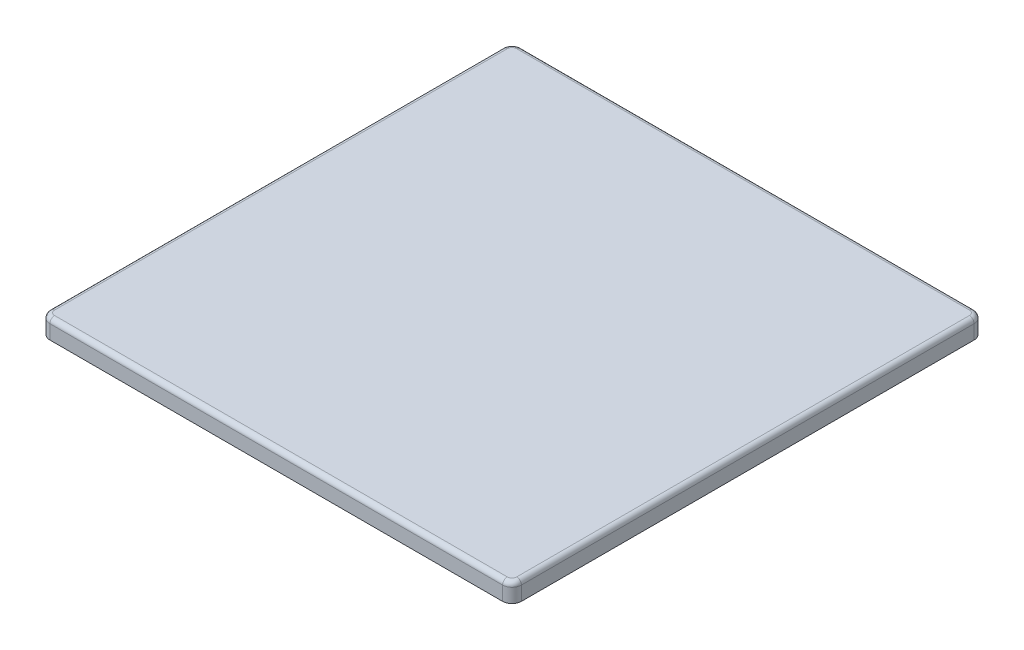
from build123d import *

# Parameters (mm, degrees)
EXTRUDE_1_DEPTH           = 2
FILLET_1_R                = 1
CUT_EXTRUDE_2_DEPTH       = 2
EXTRUDE_4_DEPTH           = 11
EXTRUDE_4_DRAFT           = 0.5
EXTRUDE_4_PROFILE_2_DEPTH = 11
EXTRUDE_4_PROFILE_2_DRAFT = 0.5
EXTRUDE_4_PROFILE_3_DEPTH = 11
EXTRUDE_4_PROFILE_3_DRAFT = 0.5
EXTRUDE_4_PROFILE_4_DEPTH = 11
EXTRUDE_4_PROFILE_4_DRAFT = 0.5
FILLET_2_R                = 0.8


with BuildPart() as part:
    # Sketch 1 → Extrude 1 (new, symmetric)
    with BuildSketch(Plane(origin=(0, 0, 0), x_dir=(0, 0, -1), z_dir=(0, 1, 0))):
        with BuildLine():
            Line((-48, 50), (48, 50))
            ThreePointArc((48, 50), (49.414213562, 49.414213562), (50, 48))
            Line((50, 48), (50, -48))
            ThreePointArc((50, -48), (49.414213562, -49.414213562), (48, -50))
            Line((48, -50), (-48, -50))
            ThreePointArc((-48, -50), (-49.414213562, -49.414213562), (-50, -48))
            Line((-50, -48), (-50, 48))
            ThreePointArc((-50, 48), (-49.414213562, 49.414213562), (-48, 50))
        make_face()
    extrude(amount=EXTRUDE_1_DEPTH, both=True)

    # Fillet 1
    fillet_1_edges = [part.edges().sort_by_distance(p)[0] for p in [
        (-49.414213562, 2, 49.414213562),
        (0, 2, 50),
        (49.414213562, 2, 49.414213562),
        (50, 2, 0),
        (49.414213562, 2, -49.414213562),
        (0, 2, -50),
        (-49.414213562, 2, -49.414213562),
        (-50, 2, 0),
    ]]
    fillet(fillet_1_edges, radius=FILLET_1_R)

    # Sketch 2 → Cut-Extrude 2 (cut)
    with BuildSketch(Plane.XZ.offset(2)):
        with BuildLine():
            Line((-47.2, 48), (47.2, 48))
            ThreePointArc((47.2, 48), (47.765685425, 47.765685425), (48, 47.2))
            Line((48, 47.2), (48, -47.2))
            ThreePointArc((48, -47.2), (47.765685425, -47.765685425), (47.2, -48))
            Line((47.2, -48), (-47.2, -48))
            ThreePointArc((-47.2, -48), (-47.765685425, -47.765685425), (-48, -47.2))
            Line((-48, -47.2), (-48, 47.2))
            ThreePointArc((-48, 47.2), (-47.765685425, 47.765685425), (-47.2, 48))
        make_face()
    extrude(amount=-CUT_EXTRUDE_2_DEPTH, mode=Mode.SUBTRACT)


with BuildPart() as extrude_4_tool:
    # Sketch 4 → Extrude 4 (with draft: the straight prism first)
    with BuildSketch(Plane.XZ):
        Polygon((25.707106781, -28.74766594), (28.74766594, -25.707106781), (24.292893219, -21.25233406), (21.25233406, -24.292893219), align=None)
    extrude(amount=EXTRUDE_4_DEPTH)
    # Extrude 4: the draft: its side faces are tilted about the plane it starts from
    extrude_4_sides = [extrude_4_tool.faces().sort_by_distance(p)[0] for p in [
        (27.227386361, -5.5, -27.227386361),
        (26.52027958, -5.5, -23.47972042),
        (22.772613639, -5.5, -22.772613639),
        (23.47972042, -5.5, -26.52027958),
    ]]
    draft(extrude_4_sides, Plane.XZ, EXTRUDE_4_DRAFT)


with BuildPart() as part_1:
    add(part.part)

    # Extrude 4: add extrude_4_tool
    add(extrude_4_tool.part)


with BuildPart() as extrude_4_profile_2_tool:
    # Sketch 4 → Extrude 4 profile 2 (with draft: the straight prism first)
    with BuildSketch(Plane.XZ):
        Polygon((-28.74766594, 25.707106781), (-24.292893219, 21.25233406), (-21.25233406, 24.292893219), (-25.707106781, 28.74766594), align=None)
    extrude(amount=EXTRUDE_4_PROFILE_2_DEPTH)
    # Extrude 4 profile 2: the draft: its side faces are tilted about the plane it starts from
    extrude_4_profile_2_sides = [extrude_4_profile_2_tool.faces().sort_by_distance(p)[0] for p in [
        (-26.52027958, -5.5, 23.47972042),
        (-22.772613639, -5.5, 22.772613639),
        (-23.47972042, -5.5, 26.52027958),
        (-27.227386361, -5.5, 27.227386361),
    ]]
    draft(extrude_4_profile_2_sides, Plane.XZ, EXTRUDE_4_PROFILE_2_DRAFT)


with BuildPart() as part_2:
    add(part_1.part)

    # Extrude 4 profile 2: add extrude_4_profile_2_tool
    add(extrude_4_profile_2_tool.part)


with BuildPart() as extrude_4_profile_3_tool:
    # Sketch 4 → Extrude 4 profile 3 (with draft: the straight prism first)
    with BuildSketch(Plane.XZ):
        Polygon((21.25233406, 25.707106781), (25.707106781, 21.25233406), (28.74766594, 24.292893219), (24.292893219, 28.74766594), align=None)
    extrude(amount=EXTRUDE_4_PROFILE_3_DEPTH)
    # Extrude 4 profile 3: the draft: its side faces are tilted about the plane it starts from
    extrude_4_profile_3_sides = [extrude_4_profile_3_tool.faces().sort_by_distance(p)[0] for p in [
        (23.47972042, -5.5, 23.47972042),
        (27.227386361, -5.5, 22.772613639),
        (26.52027958, -5.5, 26.52027958),
        (22.772613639, -5.5, 27.227386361),
    ]]
    draft(extrude_4_profile_3_sides, Plane.XZ, EXTRUDE_4_PROFILE_3_DRAFT)


with BuildPart() as part_3:
    add(part_2.part)

    # Extrude 4 profile 3: add extrude_4_profile_3_tool
    add(extrude_4_profile_3_tool.part)


with BuildPart() as extrude_4_profile_4_tool:
    # Sketch 4 → Extrude 4 profile 4 (with draft: the straight prism first)
    with BuildSketch(Plane.XZ):
        Polygon((-25.707106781, -21.25233406), (-28.74766594, -24.292893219), (-24.292893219, -28.74766594), (-21.25233406, -25.707106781), align=None)
    extrude(amount=EXTRUDE_4_PROFILE_4_DEPTH)
    # Extrude 4 profile 4: the draft: its side faces are tilted about the plane it starts from
    extrude_4_profile_4_sides = [extrude_4_profile_4_tool.faces().sort_by_distance(p)[0] for p in [
        (-27.227386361, -5.5, -22.772613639),
        (-26.52027958, -5.5, -26.52027958),
        (-22.772613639, -5.5, -27.227386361),
        (-23.47972042, -5.5, -23.47972042),
    ]]
    draft(extrude_4_profile_4_sides, Plane.XZ, EXTRUDE_4_PROFILE_4_DRAFT)


with BuildPart() as part_4:
    add(part_3.part)

    # Extrude 4 profile 4: add extrude_4_profile_4_tool
    add(extrude_4_profile_4_tool.part)

    # Fillet 2
    fillet_2_edges = [part_4.edges().sort_by_distance(p)[0] for p in [
        (23.547599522, -11, -26.452400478),
        (27.159507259, -11, -27.159507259),
        (26.452400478, -11, -23.547599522),
        (22.840492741, -11, -22.840492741),
        (-26.452400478, -11, 23.547599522),
        (-22.840492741, -11, 22.840492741),
        (-23.547599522, -11, 26.452400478),
        (-27.159507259, -11, 27.159507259),
        (-26.452400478, -11, -26.452400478),
        (-22.840492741, -11, -27.159507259),
        (-23.547599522, -11, -23.547599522),
        (-27.159507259, -11, -22.840492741),
        (23.547599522, -11, 23.547599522),
        (27.159507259, -11, 22.840492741),
        (26.452400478, -11, 26.452400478),
        (22.840492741, -11, 27.159507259),
    ]]
    fillet(fillet_2_edges, radius=FILLET_2_R)


solid = part_4.part
